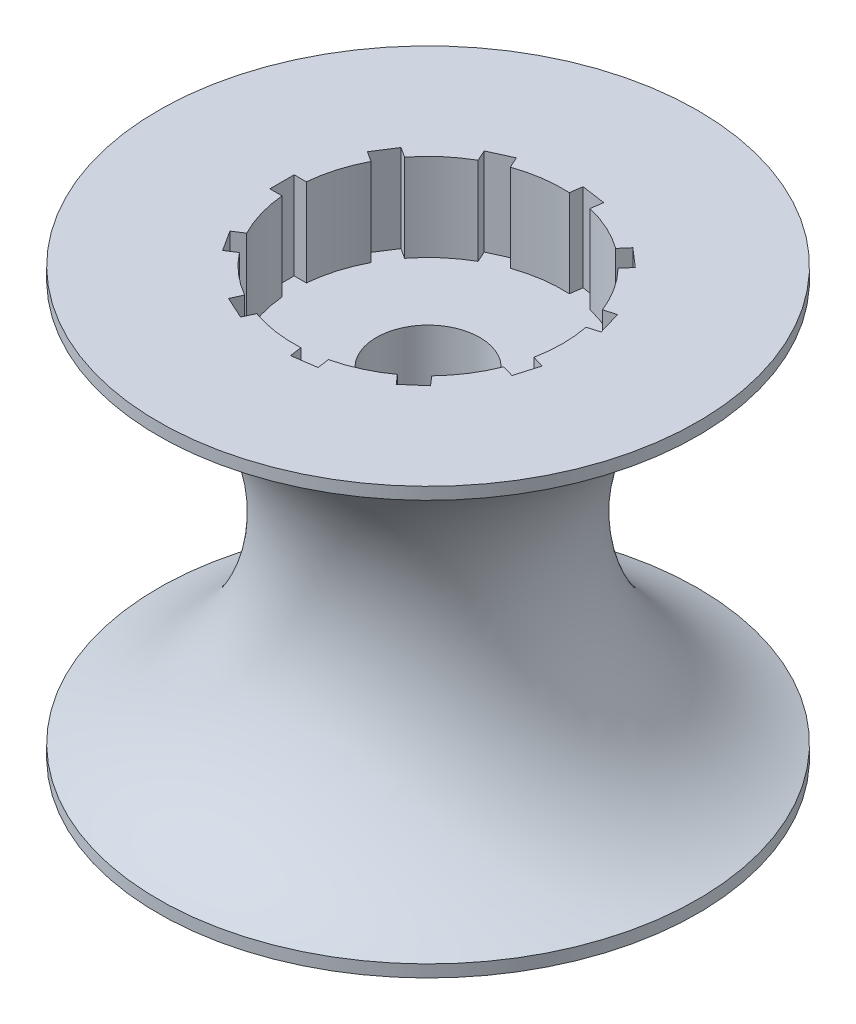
from build123d import *
from build123d.topology import SkipClean

# Parameters (mm, degrees)
ESQUISSE2_R                  = 4.25
ENL_V_MAT_EXTRU_1_DEPTH      = 87
ESQUISSE3_R                  = 11.05
ENL_V_MAT_EXTRU_2_DEPTH      = 7.2
ESQUISSE6_W                  = 1
ESQUISSE6_H                  = 2
ENL_V_MAT_EXTRU_5_DEPTH      = 7.2
R_P_TITION_CIRCULAIRE1_COUNT = 11


with BuildPart() as part:
    # Esquisse1 → R_volution1 (revolve)
    with BuildSketch(Plane(origin=(0, 0, 0), x_dir=(0, 0, -1), z_dir=(1, 0, 0)), mode=Mode.PRIVATE) as r_volution1_sk:
        with BuildLine():
            Line((0, 0), (-22.169048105, 0))
            Line((-22.169048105, 0), (-22.169048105, 1))
            ThreePointArc((-22.169048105, 1), (-13.712039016, 7.395339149), (-10.5, 17.5))
            Line((-10.5, 17.5), (0, 17.5))
            Line((0, 17.5), (0, 0))
        make_face()
    revolve(r_volution1_sk.sketch.rotate(Axis((0, 0, 0), (0, 1, 0)), 180), axis=Axis((0, 0, 0), (0, 1, 0)))

    # Esquisse2 → Enl_v. mat.-Extru.1 (cut)
    with BuildSketch(Plane.XZ):
        with Locations(Location((0, 0, 0), (0, 0, 270))):
            Circle(ESQUISSE2_R)
    extrude(amount=-ENL_V_MAT_EXTRU_1_DEPTH, mode=Mode.SUBTRACT)

    # Esquisse3 → Enl_v. mat.-Extru.2 (cut)
    with BuildSketch(Plane(origin=(0, 0, 0), x_dir=(-1, 0, 0), z_dir=(0, -1, 0))):
        with Locations(Location((0, 0, 0), (0, 0, 90))):
            Circle(ESQUISSE3_R)
    extrude(amount=-ENL_V_MAT_EXTRU_2_DEPTH, mode=Mode.SUBTRACT)

    # Esquisse6 → Enl_v. mat.-Extru.5 (cut)
    with BuildSketch(Plane.XZ):
        with Locations((-11.504658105, 0)):
            Rectangle(ESQUISSE6_W, ESQUISSE6_H)
    enl_v_mat_extru_5 = extrude(amount=-ENL_V_MAT_EXTRU_5_DEPTH, mode=Mode.SUBTRACT)

    # R_p_tition circulaire1: Enl_v. mat.-Extru.5 ×11 about axis
    r_p_tition_circulaire1_axis = Axis((0, 0, 0), (0, 1, 0))
    for i in range(1, R_P_TITION_CIRCULAIRE1_COUNT):
        add(enl_v_mat_extru_5.rotate(r_p_tition_circulaire1_axis, i * 360 / R_P_TITION_CIRCULAIRE1_COUNT), mode=Mode.SUBTRACT)

    # Sym_trie1: part across plane


with BuildPart() as part_1:
    with SkipClean():  # the faces are left unmerged after this step: merging them gives an invalid solid
        add(part.part)
        add(part.part.mirror(Plane(origin=(0, 17.5, 10.5), x_dir=(0, 0, 1), z_dir=(0, -1, 0))))


solid = part_1.part
